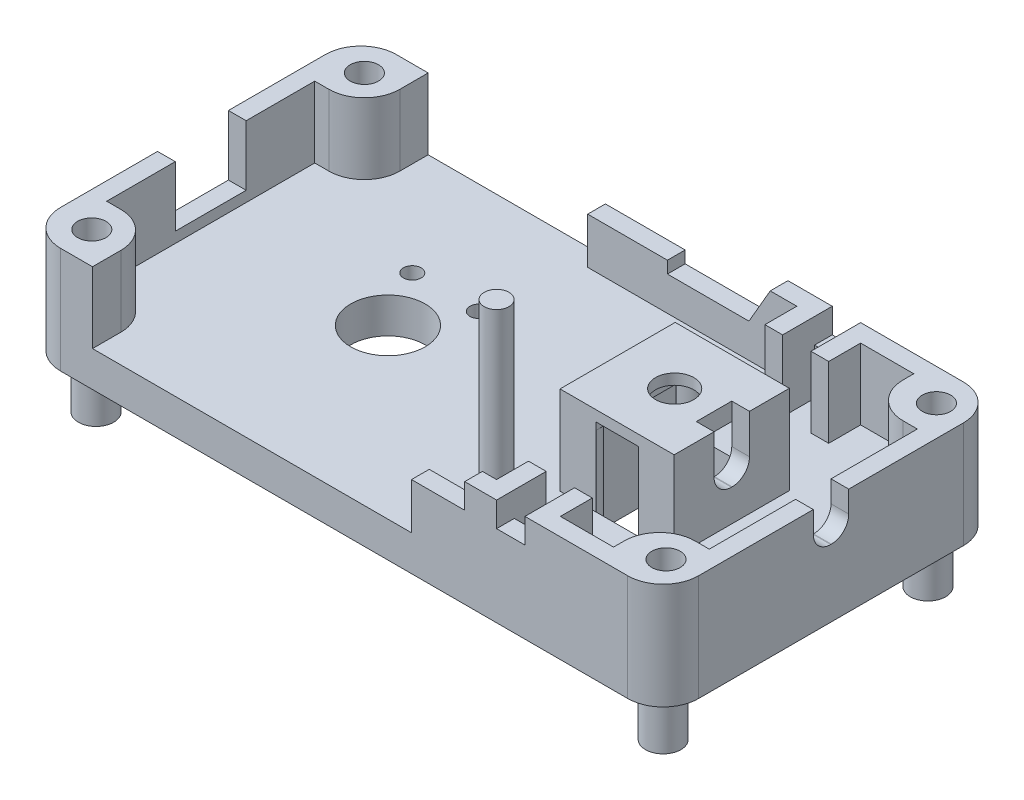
from build123d import *

# Parameters (mm, degrees)
SKETCH1_W               = 45.72
SKETCH1_H               = 24.0538
BOSS_EXTRUDE1_DEPTH     = 7.62
FILLET1_R               = 2.54
SKETCH2_W               = 43.18
SKETCH2_H               = 14.9098
SKETCH2_W_2             = 8.1788
SKETCH2_H_2             = 8.255
CUT_EXTRUDE1_DEPTH      = 5.08
SKETCH3_W               = 22.86
SKETCH3_H               = 4.572
CUT_EXTRUDE2_DEPTH      = 5.08
SKETCH4_W               = 12.7
SKETCH4_H               = 4.572
CUT_EXTRUDE3_DEPTH      = 5.08
SKETCH5_R               = 2.667
SKETCH5_R_2             = 0.635
SKETCH5_W               = 5.588
SKETCH5_H               = 8.255
CUT_EXTRUDE4_DEPTH      = 5.08
FILLET3_R               = 2.54
FILLET4_R               = 2.54
SKETCH6_R               = 1.016
CUT_EXTRUDE5_DEPTH      = 6.604
SKETCH7_W               = 2.032
SKETCH7_H               = 24.0538
CUT_EXTRUDE6_DEPTH      = 1.778
SKETCH10_W              = 23.368
SKETCH10_H              = 3.302
SKETCH10_W_2            = 13.208
CUT_EXTRUDE7_DEPTH      = 5.08
FILLET5_R               = 2.54
FILLET6_R               = 2.54
CUT_EXTRUDE8_DEPTH      = 53.220380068
CUT_EXTRUDE8_DEPTH_BACK = 7.62
SKETCH15_W              = 3.81
SKETCH15_H              = 1.778
CUT_EXTRUDE9_DEPTH      = 7.62
SKETCH26_W              = 5.588
SKETCH26_H              = 2.54
CUT_EXTRUDE15_DEPTH     = 9.652
SKETCH27_W              = 8.1788
SKETCH27_H              = 8.255
SKETCH27_R              = 1.3716
BOSS_EXTRUDE16_DEPTH    = 1.27
BOSS_EXTRUDE17_DEPTH    = 7.62
SKETCH29_W              = 1.27
SKETCH29_H              = 2.54
CUT_EXTRUDE16_DEPTH     = 1.778
CUT_EXTRUDE17_DEPTH     = 8.89
SKETCH32_W              = 1.27
SKETCH32_H              = 2.286
BOSS_EXTRUDE18_DEPTH    = 5.08
SKETCH33_W              = 5.08
SKETCH33_H              = 4.318
CUT_EXTRUDE18_DEPTH     = 5.08
SKETCH34_W              = 3.048
SKETCH34_H              = 0.508
CUT_EXTRUDE19_DEPTH     = 10.922
SKETCH35_R              = 0.889
BOSS_EXTRUDE19_DEPTH    = 12.7
SKETCH36_R              = 1.27
BOSS_EXTRUDE20_DEPTH    = 3.81


with BuildPart() as part:
    # Sketch1 → Boss-Extrude1 (new body)
    with BuildSketch(Plane(origin=(0, 0, 0), x_dir=(1, 0, 0), z_dir=(0, 1, 0))):
        with Locations((-22.86, 12.0269)):
            Rectangle(SKETCH1_W, SKETCH1_H)
    extrude(amount=BOSS_EXTRUDE1_DEPTH)

    # Fillet1
    fillet1_edges = [part.edges().sort_by_distance(p)[0] for p in [
        (0, 3.81, 0),
        (-45.72, 3.81, 0),
        (-45.72, 3.81, -24.0538),
        (0, 3.81, -24.0538),
    ]]
    fillet(fillet1_edges, radius=FILLET1_R)

    # Sketch2 → Cut-Extrude1 (cut)
    with BuildSketch(Plane(origin=(0, 7.62, 0), x_dir=(1, 0, 0), z_dir=(0, 1, 0))):
        with Locations((-22.86, 12.0269)):
            Rectangle(SKETCH2_W, SKETCH2_H)
        with Locations((-11.2014, 12.0269)):
            Rectangle(SKETCH2_W_2, SKETCH2_H_2, mode=Mode.SUBTRACT)
    extrude(amount=-CUT_EXTRUDE1_DEPTH, mode=Mode.SUBTRACT)

    # Sketch3 → Cut-Extrude2 (cut)
    with BuildSketch(Plane(origin=(0, 7.62, 0), x_dir=(1, 0, 0), z_dir=(0, 1, 0))):
        with Locations((-29.464, 2.286)):
            Rectangle(SKETCH3_W, SKETCH3_H)
    extrude(amount=-CUT_EXTRUDE2_DEPTH, mode=Mode.SUBTRACT)

    # Sketch4 → Cut-Extrude3 (cut)
    with BuildSketch(Plane(origin=(0, 7.62, 0), x_dir=(1, 0, 0), z_dir=(0, 1, 0))):
        with Locations((-34.544, 21.7678)):
            Rectangle(SKETCH4_W, SKETCH4_H)
    extrude(amount=-CUT_EXTRUDE3_DEPTH, mode=Mode.SUBTRACT)

    # Sketch5 → Cut-Extrude4 (cut)
    with BuildSketch(Plane.XZ):
        with Locations(Location((-31.75, -12.0269, 0), (0, 0, 270))):
            Circle(SKETCH5_R)
        with Locations(Location((-34.133013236, -16.1544, 0), (0, 0, 270))):
            Circle(SKETCH5_R_2)
        with Locations(Location((-29.366986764, -16.1544, 0), (0, 0, 270))):
            Circle(SKETCH5_R_2)
        with Locations((-11.176, -12.0269)):
            Rectangle(SKETCH5_W, SKETCH5_H)
        with BuildLine():
            Line((-19.742440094, -19.485784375), (-18.398398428, -17.961784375))
            ThreePointArc((-18.398398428, -17.961784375), (-17.322882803, -17.8943), (-17.255398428, -18.969815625))
            Line((-17.255398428, -18.969815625), (-18.599440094, -20.493815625))
            ThreePointArc((-18.599440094, -20.493815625), (-19.674955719, -20.5613), (-19.742440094, -19.485784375))
        make_face()
    extrude(amount=-CUT_EXTRUDE4_DEPTH, mode=Mode.SUBTRACT)

    # Fillet3
    fillet3_edges = [part.edges().sort_by_distance(p)[0] for p in [
        (-40.894, 5.08, -19.4818),
    ]]
    fillet(fillet3_edges, radius=FILLET3_R)

    # Fillet4
    fillet4_edges = [part.edges().sort_by_distance(p)[0] for p in [
        (-40.894, 5.08, -4.572),
    ]]
    fillet(fillet4_edges, radius=FILLET4_R)

    # Sketch6 → Cut-Extrude5 (cut)
    with BuildSketch(Plane(origin=(0, 7.62, 0), x_dir=(1, 0, 0), z_dir=(0, 1, 0))):
        with Locations(Location((-43.18, 21.7678, 0), (0, 0, 270))):
            Circle(SKETCH6_R)
        with Locations(Location((-43.2308, 2.286, 0), (0, 0, 270))):
            Circle(SKETCH6_R)
        with Locations(Location((-2.1844, 21.7678, 0), (0, 0, 270))):
            Circle(SKETCH6_R)
        with Locations(Location((-2.1844, 2.3876, 0), (0, 0, 270))):
            Circle(SKETCH6_R)
    extrude(amount=-CUT_EXTRUDE5_DEPTH, mode=Mode.SUBTRACT)

    # Sketch7 → Cut-Extrude6 (cut)
    with BuildSketch(Plane(origin=(0, 7.62, 0), x_dir=(1, 0, 0), z_dir=(0, 1, 0))):
        with Locations((-10.922, 12.0269)):
            Rectangle(SKETCH7_W, SKETCH7_H)
    extrude(amount=-CUT_EXTRUDE6_DEPTH, mode=Mode.SUBTRACT)

    # Sketch10 → Cut-Extrude7 (cut)
    with BuildSketch(Plane(origin=(0, 7.62, 0), x_dir=(1, 0, 0), z_dir=(0, 1, 0))):
        with Locations((-16.51, 21.1328)):
            Rectangle(SKETCH10_W, SKETCH10_H)
        with Locations((-11.43, 2.921)):
            Rectangle(SKETCH10_W_2, SKETCH10_H)
    extrude(amount=-CUT_EXTRUDE7_DEPTH, mode=Mode.SUBTRACT)

    # Fillet5
    fillet5_edges = [part.edges().sort_by_distance(p)[0] for p in [
        (-4.826, 5.08, -19.4818),
    ]]
    fillet(fillet5_edges, radius=FILLET5_R)

    # Fillet6
    fillet6_edges = [part.edges().sort_by_distance(p)[0] for p in [
        (-4.826, 5.08, -4.572),
    ]]
    fillet(fillet6_edges, radius=FILLET6_R)

    # Sketch14 → Cut-Extrude8 (cut, two sides: drawn at the far end of the back side and taken through both)
    with BuildSketch(Plane(origin=(0, 0, -24.0538), x_dir=(-1, 0, 0), z_dir=(0, 0, -1)).offset(-CUT_EXTRUDE8_DEPTH_BACK)):
        Polygon((28.194, 7.62), (15.113, 7.62), (16.637, 4.980354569), (22.479, 4.980354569), (22.479, 5.842), (28.194, 5.842), align=None)
    extrude(amount=CUT_EXTRUDE8_DEPTH + CUT_EXTRUDE8_DEPTH_BACK, mode=Mode.SUBTRACT)

    # Sketch15 → Cut-Extrude9 (cut)
    with BuildSketch(Plane.XY):
        with Locations((-16.129, 6.731)):
            Rectangle(SKETCH15_W, SKETCH15_H)
    extrude(amount=-CUT_EXTRUDE9_DEPTH, mode=Mode.SUBTRACT)

    # Sketch26 → Cut-Extrude15 (cut)
    with BuildSketch(Plane.XY.offset(-7.8994)):
        with Locations((-11.176, 6.35)):
            Rectangle(SKETCH26_W, SKETCH26_H)
    extrude(amount=-CUT_EXTRUDE15_DEPTH, mode=Mode.SUBTRACT)

    # Sketch27 → Boss-Extrude16 (add)
    with BuildSketch(Plane(origin=(0, 7.62, 0), x_dir=(1, 0, 0), z_dir=(0, 1, 0))):
        with Locations((-11.2014, 12.0269)):
            Rectangle(SKETCH27_W, SKETCH27_H)
        with Locations(Location((-11.2014, 12.0269, 0), (0, 0, 270))):
            Circle(SKETCH27_R, mode=Mode.SUBTRACT)
    extrude(amount=BOSS_EXTRUDE16_DEPTH)

    # Sketch28 → Boss-Extrude17 (add)
    with BuildSketch(Plane.XZ):
        with BuildLine():
            Line((-13.97, -16.1544), (-12.7, -16.1544))
            Line((-12.7, -16.1544), (-12.7, -16.129))
            ThreePointArc((-12.7, -16.129), (-13.0645349, -15.2489349), (-13.9446, -14.8844))
            Line((-13.9446, -14.8844), (-13.97, -14.8844))
            Line((-13.97, -14.8844), (-13.97, -16.1544))
        make_face()
        with BuildLine():
            Line((-8.382, -16.1544), (-9.652, -16.1544))
            Line((-9.652, -16.1544), (-9.652, -16.129))
            ThreePointArc((-9.652, -16.129), (-9.2874651, -15.2489349), (-8.4074, -14.8844))
            Line((-8.4074, -14.8844), (-8.382, -14.8844))
            Line((-8.382, -14.8844), (-8.382, -16.1544))
        make_face()
        with BuildLine():
            Line((-8.382, -7.8994), (-9.652, -7.8994))
            Line((-9.652, -7.8994), (-9.652, -7.9248))
            ThreePointArc((-9.652, -7.9248), (-9.2874651, -8.8048651), (-8.4074, -9.1694))
            Line((-8.4074, -9.1694), (-8.382, -9.1694))
            Line((-8.382, -9.1694), (-8.382, -7.8994))
        make_face()
        with BuildLine():
            Line((-13.97, -7.8994), (-12.7, -7.8994))
            Line((-12.7, -7.8994), (-12.7, -7.9248))
            ThreePointArc((-12.7, -7.9248), (-13.0645349, -8.8048651), (-13.9446, -9.1694))
            Line((-13.9446, -9.1694), (-13.97, -9.1694))
            Line((-13.97, -9.1694), (-13.97, -7.8994))
        make_face()
    extrude(amount=-BOSS_EXTRUDE17_DEPTH)

    # Sketch29 → Cut-Extrude16 (cut)
    with BuildSketch(Plane(origin=(0, 8.89, 0), x_dir=(1, 0, 0), z_dir=(0, 1, 0))):
        with Locations((-7.747, 12.0269)):
            Rectangle(SKETCH29_W, SKETCH29_H)
    extrude(amount=-CUT_EXTRUDE16_DEPTH, mode=Mode.SUBTRACT)

    # Sketch30 → Cut-Extrude17 (cut)
    with BuildSketch(Plane(origin=(0, 0, 0), x_dir=(0, 0, -1), z_dir=(1, 0, 0))):
        with BuildLine():
            Line((12.0523, 4.826), (12.0015, 4.826))
            ThreePointArc((12.0015, 4.826), (11.1214349, 5.1905349), (10.7569, 6.0706))
            Line((10.7569, 6.0706), (10.7569, 7.62))
            Line((10.7569, 7.62), (13.2969, 7.62))
            Line((13.2969, 7.62), (13.2969, 6.0706))
            ThreePointArc((13.2969, 6.0706), (12.9323651, 5.1905349), (12.0523, 4.826))
        make_face()
    extrude(amount=-CUT_EXTRUDE17_DEPTH, mode=Mode.SUBTRACT)

    # Sketch32 → Boss-Extrude18 (add)
    with BuildSketch(Plane(origin=(0, 2.54, 0), x_dir=(1, 0, 0), z_dir=(0, 1, 0))):
        with Locations((-9.271, 2.413)):
            Rectangle(SKETCH32_W, SKETCH32_H)
        with Locations((-12.573, 2.413)):
            Rectangle(SKETCH32_W, SKETCH32_H)
        with Locations((-9.271, 21.6408)):
            Rectangle(SKETCH32_W, SKETCH32_H)
        with Locations((-12.573, 21.6408)):
            Rectangle(SKETCH32_W, SKETCH32_H)
    extrude(amount=BOSS_EXTRUDE18_DEPTH)

    # Sketch33 → Cut-Extrude18 (cut)
    with BuildSketch(Plane.ZY.offset(45.72)):
        with Locations((-12.0269, 5.461)):
            Rectangle(SKETCH33_W, SKETCH33_H)
    extrude(amount=-CUT_EXTRUDE18_DEPTH, mode=Mode.SUBTRACT)

    # Sketch34 → Cut-Extrude19 (cut)
    with BuildSketch(Plane(origin=(0, 0, -16.1544), x_dir=(-1, 0, 0), z_dir=(0, 0, -1))):
        with Locations((11.176, 7.874)):
            Rectangle(SKETCH34_W, SKETCH34_H)
    extrude(amount=-CUT_EXTRUDE19_DEPTH, mode=Mode.SUBTRACT)

    # Sketch35 → Boss-Extrude19 (add)
    with BuildSketch(Plane(origin=(0, 2.54, 0), x_dir=(1, 0, 0), z_dir=(0, 1, 0))):
        with Locations(Location((-16.764, 4.826, 0), (0, 0, 270))):
            Circle(SKETCH35_R)
    extrude(amount=BOSS_EXTRUDE19_DEPTH)

    # Sketch36 → Boss-Extrude20 (add)
    with BuildSketch(Plane.XZ):
        with Locations(Location((-43.18, -2.54, 0), (0, 0, 90))):
            Circle(SKETCH36_R)
        with Locations(Location((-43.18, -21.5138, 0), (0, 0, 90))):
            Circle(SKETCH36_R)
        with Locations(Location((-2.54, -2.54, 0), (0, 0, 90))):
            Circle(SKETCH36_R)
        with Locations(Location((-2.54, -21.5138, 0), (0, 0, 90))):
            Circle(SKETCH36_R)
    extrude(amount=BOSS_EXTRUDE20_DEPTH)


solid = part.part
